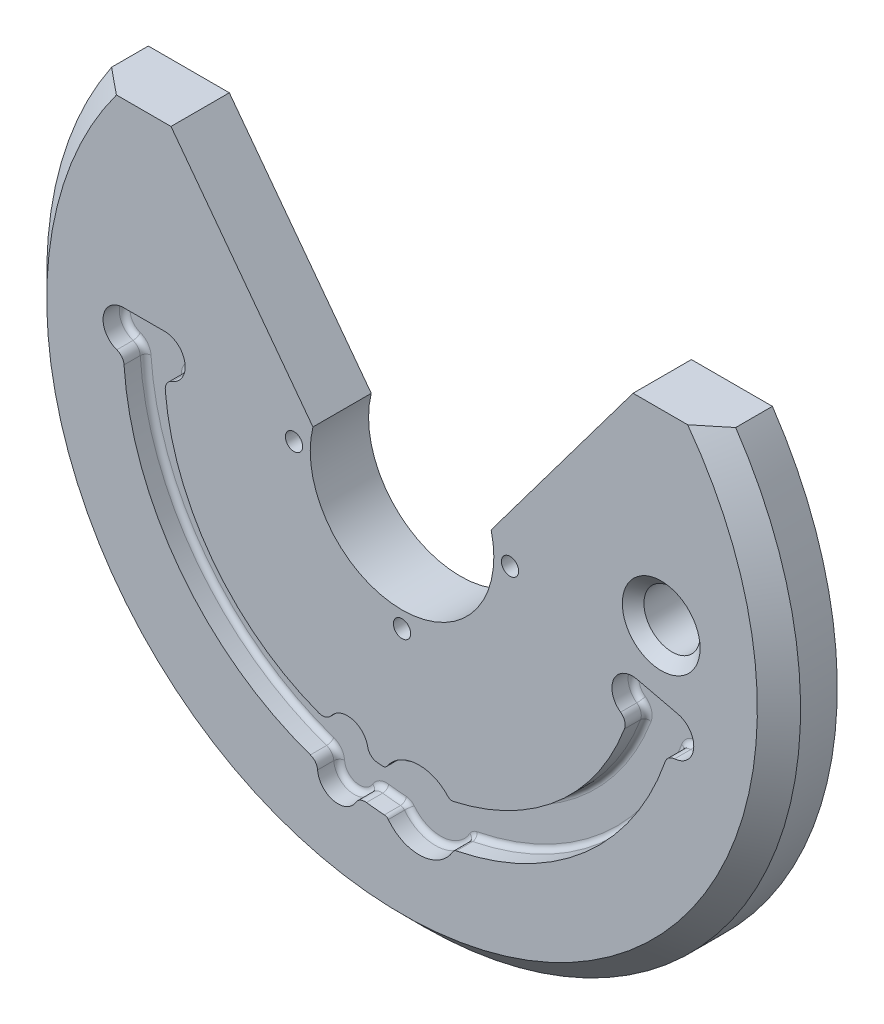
from build123d import *

# Parameters (mm, degrees)
SKETCH1_R               = 34.9
SKETCH1_R_2             = 8.5
EXTRUDE1_DEPTH          = 5.4
CUT_EXTRUDE1_DEPTH      = 6
CUT_EXTRUDE2_DEPTH      = 2
FILLET1_R               = 0.5
SKETCH4_R               = 0.8
CUT_EXTRUDE3_DEPTH      = 6
CUT_EXTRUDE4_DEPTH      = 11
CUT_EXTRUDE4_DEPTH_BACK = 1
SKETCH6_R               = 0.6
CUT_EXTRUDE5_DEPTH      = 11
CUT_EXTRUDE5_DEPTH_BACK = 1.5
SKETCH8_R               = 0.6
SKETCH9_R               = 2.6
CUT_EXTRUDE7_DEPTH      = 10
CHAMFER1_SIZE           = 1
CHAMFER2_SIZE           = 2


with BuildPart() as part:
    # Sketch1 → Extrude1 (new body)
    with BuildSketch(Plane.XY):
        with Locations(Location((0, 0, 0), (0, 0, 180))):
            Circle(SKETCH1_R)
        with Locations(Location((0, 0, 0), (0, 0, 180))):
            Circle(SKETCH1_R_2, mode=Mode.SUBTRACT)
    extrude(amount=EXTRUDE1_DEPTH)

    # Sketch2 → Cut-Extrude1 (cut)
    with BuildSketch(Plane.XY):
        with BuildLine():
            Line((30.918120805, 19.575082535), (21.393358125, 19.575082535))
            Line((21.393358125, 19.575082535), (8.25, 2.046338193))
            ThreePointArc((8.25, 2.046338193), (0, -8.5), (-8.25, 2.046338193))
            Line((-8.25, 2.046338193), (-21.393358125, 19.575082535))
            Line((-21.393358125, 19.575082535), (-30.918120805, 19.575082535))
            ThreePointArc((-30.918120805, 19.575082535), (0, 36.593907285), (30.918120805, 19.575082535))
        make_face()
    extrude(amount=CUT_EXTRUDE1_DEPTH, mode=Mode.SUBTRACT)

    # Sketch3 → Cut-Extrude2 (cut)
    with BuildSketch(Plane.XY.offset(5.4)):
        with BuildLine():
            Line((-25.782503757, 2.85), (-21.979479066, 2.85))
            ThreePointArc((-21.979479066, 2.85), (-20.112160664, 1.300887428), (-21.289775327, -0.820397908))
            ThreePointArc((-21.289775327, -0.820397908), (-21.775148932, -1.222791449), (-21.923286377, -1.835623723))
            ThreePointArc((-21.923286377, -1.835623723), (-17.540762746, -13.278615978), (-7.716667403, -20.60225823))
            ThreePointArc((-7.716667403, -20.60225823), (-7.086632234, -20.626002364), (-6.567612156, -20.268055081))
            ThreePointArc((-6.567612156, -20.268055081), (-4.614637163, -19.563106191), (-3.182583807, -21.066531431))
            ThreePointArc((-3.182583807, -21.066531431), (-2.878245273, -21.618696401), (-2.304015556, -21.879019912))
            ThreePointArc((-2.304015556, -21.879019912), (-2.071084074, -21.902296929), (-1.837918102, -21.923094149))
            ThreePointArc((-1.837918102, -21.923094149), (-1.582057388, -21.876688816), (-1.38410212, -21.708071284))
            ThreePointArc((-1.38410212, -21.708071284), (1.343234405, -20.155290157), (4.252504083, -21.332423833))
            ThreePointArc((4.252504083, -21.332423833), (4.471084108, -21.473281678), (4.730840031, -21.485324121))
            ThreePointArc((4.730840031, -21.485324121), (14.403340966, -16.629605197), (20.590016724, -7.749271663))
            ThreePointArc((20.590016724, -7.749271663), (20.610370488, -7.104525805), (20.232811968, -6.581495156))
            ThreePointArc((20.232811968, -6.581495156), (19.600904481, -4.249612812), (21.768561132, -3.182726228))
            Line((21.768561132, -3.182726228), (25.547062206, -4.074016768))
            ThreePointArc((25.547062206, -4.074016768), (27.004505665, -6.078438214), (25.240196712, -7.818857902))
            ThreePointArc((25.240196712, -7.818857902), (24.701611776, -8.021577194), (24.36393397, -8.487562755))
            ThreePointArc((24.36393397, -8.487562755), (16.935398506, -19.463614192), (5.037752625, -25.303380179))
            ThreePointArc((5.037752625, -25.303380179), (4.843905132, -25.387504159), (4.702119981, -25.544190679))
            ThreePointArc((4.702119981, -25.544190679), (1.822011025, -27.339353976), (-1.270843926, -25.942254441))
            ThreePointArc((-1.270843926, -25.942254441), (-1.432167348, -25.805768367), (-1.635463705, -25.748111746))
            ThreePointArc((-1.635463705, -25.748111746), (-2.466771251, -25.681803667), (-3.295501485, -25.588662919))
            ThreePointArc((-3.295501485, -25.588662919), (-3.863267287, -25.682490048), (-4.285311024, -26.073694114))
            ThreePointArc((-4.285311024, -26.073694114), (-6.359466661, -26.960065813), (-7.818847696, -25.240186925))
            ThreePointArc((-7.818847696, -25.240186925), (-8.021570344, -24.701610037), (-8.487552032, -24.363937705))
            ThreePointArc((-8.487552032, -24.363937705), (-20.520863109, -15.637588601), (-25.742565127, -1.720564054))
            ThreePointArc((-25.742565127, -1.720564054), (-25.944535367, -1.181697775), (-26.410050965, -0.843372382))
            ThreePointArc((-26.410050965, -0.843372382), (-27.655657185, 1.268270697), (-25.782503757, 2.85))
        make_face()
    extrude(amount=-CUT_EXTRUDE2_DEPTH, mode=Mode.SUBTRACT)

    # Fillet1
    fillet1_edges = [part.edges().sort_by_distance(p)[0] for p in [
        (20.610370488, -7.104525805, 3.4),
        (19.600904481, -4.249612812, 3.4),
        (23.657811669, -3.628371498, 3.4),
        (27.004505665, -6.078438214, 3.4),
        (24.701611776, -8.021577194, 3.4),
        (16.935398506, -19.463614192, 3.4),
        (4.843905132, -25.387504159, 3.4),
        (1.822011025, -27.339353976, 3.4),
        (-1.432167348, -25.805768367, 3.4),
        (-2.466771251, -25.681803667, 3.4),
        (-3.863267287, -25.682490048, 3.4),
        (-6.359466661, -26.960065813, 3.4),
        (-8.021570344, -24.701610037, 3.4),
        (-20.520863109, -15.637588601, 3.4),
        (-25.944535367, -1.181697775, 3.4),
        (-27.655657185, 1.268270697, 3.4),
        (-23.880991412, 2.85, 3.4),
        (-20.112160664, 1.300887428, 3.4),
        (-21.775148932, -1.222791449, 3.4),
        (-17.540762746, -13.278615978, 3.4),
        (-7.086632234, -20.626002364, 3.4),
        (-4.614637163, -19.563106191, 3.4),
        (-2.878245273, -21.618696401, 3.4),
        (-2.071084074, -21.902296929, 3.4),
        (-1.582057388, -21.876688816, 3.4),
        (1.343234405, -20.155290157, 3.4),
        (4.471084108, -21.473281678, 3.4),
        (14.403340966, -16.629605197, 3.4),
    ]]
    fillet(fillet1_edges, radius=FILLET1_R)

    # Sketch4 → Cut-Extrude3 (cut)
    with BuildSketch(Plane.XY.offset(5.4)):
        with Locations((-10, 0)):
            Circle(SKETCH4_R)
        with Locations((0, -10)):
            Circle(SKETCH4_R)
        with Locations((10, 0)):
            Circle(SKETCH4_R)
    extrude(amount=-CUT_EXTRUDE3_DEPTH, mode=Mode.SUBTRACT)

    # Sketch6 → Cut-Extrude4 (cut, two sides: drawn at the far end of the back side and taken through both)
    with BuildSketch(Plane(origin=(-20.37078069, 0, 4.655928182), x_dir=(-0.28015820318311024, 0, -0.9599538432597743), z_dir=(0.9599538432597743, 0, -0.28015820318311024)).offset(-CUT_EXTRUDE4_DEPTH_BACK)):
        with Locations(Location((0, 0, 0), (0, 0, 180))):
            Circle(SKETCH6_R)
    extrude(amount=CUT_EXTRUDE4_DEPTH + CUT_EXTRUDE4_DEPTH_BACK, mode=Mode.SUBTRACT)

    # Sketch8 → Cut-Extrude5 (cut, two sides: drawn at the far end of the back side and taken through both)
    with BuildSketch(Plane(origin=(0, -20.489651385, 4.571170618), x_dir=(-1, 0, 0), z_dir=(0, 0.9618974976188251, -0.2734103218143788)).offset(-CUT_EXTRUDE5_DEPTH_BACK)):
        with Locations(Location((0, 0, 0), (0, 0, 270))):
            Circle(SKETCH8_R)
    extrude(amount=CUT_EXTRUDE5_DEPTH + CUT_EXTRUDE5_DEPTH_BACK, mode=Mode.SUBTRACT)

    # Sketch9 → Cut-Extrude7 (cut)
    with BuildSketch(Plane.XY):
        with Locations((23.99713513, 2.228009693)):
            Circle(SKETCH9_R)
    extrude(amount=CUT_EXTRUDE7_DEPTH, mode=Mode.SUBTRACT)

    # Chamfer1
    chamfer1_edges = [part.edges().sort_by_distance(p)[0] for p in [
        (21.39713513, 2.228009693, 5.4),
    ]]
    chamfer(chamfer1_edges, length=CHAMFER1_SIZE)

    # Chamfer2
    chamfer2_edges = [part.edges().sort_by_distance(p)[0] for p in [
        (0, -34.9, 5.4),
    ]]
    chamfer(chamfer2_edges, length=CHAMFER2_SIZE)


solid = part.part
